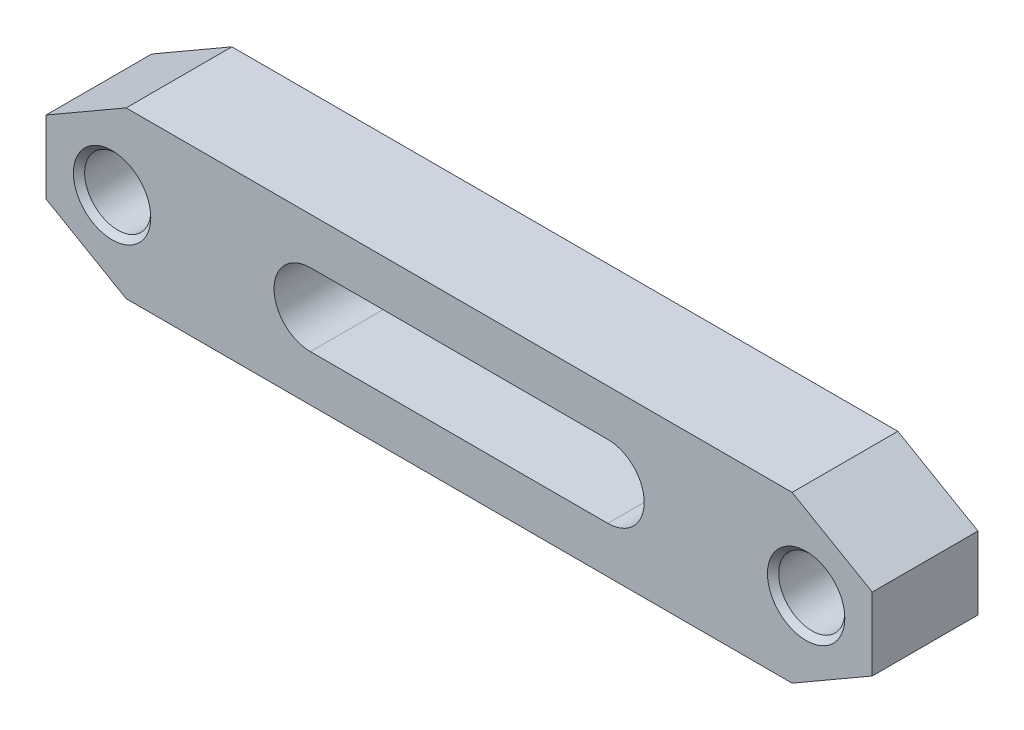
ISO-10303-21;
HEADER;
FILE_DESCRIPTION(('STEP AP214'),'2;1');
FILE_NAME('part.step','',(''),(''),'','','');
FILE_SCHEMA(('AUTOMOTIVE_DESIGN { 1 0 10303 214 1 1 1 1 }'));
ENDSEC;
DATA;
#1=APPLICATION_CONTEXT('core data for automotive mechanical design processes');
#2=APPLICATION_PROTOCOL_DEFINITION('international standard','automotive_design',2000,#1);
#3=PRODUCT_CONTEXT('',#1,'mechanical');
#4=PRODUCT('Part','Part','',(#3));
#5=PRODUCT_RELATED_PRODUCT_CATEGORY('part','',(#4));
#6=PRODUCT_DEFINITION_FORMATION('','',#4);
#7=PRODUCT_DEFINITION_CONTEXT('part definition',#1,'design');
#8=PRODUCT_DEFINITION('design','',#6,#7);
#9=PRODUCT_DEFINITION_SHAPE('','',#8);
#10=(LENGTH_UNIT() NAMED_UNIT(*) SI_UNIT(.MILLI.,.METRE.));
#11=(NAMED_UNIT(*) PLANE_ANGLE_UNIT() SI_UNIT($,.RADIAN.));
#12=(NAMED_UNIT(*) SI_UNIT($,.STERADIAN.) SOLID_ANGLE_UNIT());
#13=UNCERTAINTY_MEASURE_WITH_UNIT(LENGTH_MEASURE(1.E-05),#10,'distance_accuracy_value','');
#14=(GEOMETRIC_REPRESENTATION_CONTEXT(3) GLOBAL_UNCERTAINTY_ASSIGNED_CONTEXT((#13)) GLOBAL_UNIT_ASSIGNED_CONTEXT((#10,
#11,#12)) REPRESENTATION_CONTEXT('',''));
#15=CARTESIAN_POINT('',(0.,0.,0.));
#16=DIRECTION('',(0.,0.,1.));
#17=DIRECTION('',(1.,0.,0.));
#18=AXIS2_PLACEMENT_3D('',#15,#16,#17);
#19=CARTESIAN_POINT('',(62.5,-12.5,16.));
#20=DIRECTION('',(0.,0.,1.));
#21=DIRECTION('',(1.,0.,0.));
#22=AXIS2_PLACEMENT_3D('',#19,#20,#21);
#23=PLANE('',#22);
#24=CARTESIAN_POINT('',(52.5,0.,16.));
#25=DIRECTION('',(0.,0.,-1.));
#26=DIRECTION('',(-1.,0.,0.));
#27=AXIS2_PLACEMENT_3D('',#24,#25,#26);
#28=CIRCLE('',#27,5.85);
#29=CARTESIAN_POINT('',(46.65,0.,16.));
#30=VERTEX_POINT('',#29);
#31=EDGE_CURVE('E212',#30,#30,#28,.T.);
#32=ORIENTED_EDGE('',*,*,#31,.T.);
#33=EDGE_LOOP('',(#32));
#34=FACE_BOUND('',#33,.T.);
#35=CARTESIAN_POINT('',(-52.5,0.,16.));
#36=DIRECTION('',(0.,0.,-1.));
#37=DIRECTION('',(-1.,0.,0.));
#38=AXIS2_PLACEMENT_3D('',#35,#36,#37);
#39=CIRCLE('',#38,5.85);
#40=CARTESIAN_POINT('',(-58.35,0.,16.));
#41=VERTEX_POINT('',#40);
#42=EDGE_CURVE('E133',#41,#41,#39,.T.);
#43=ORIENTED_EDGE('',*,*,#42,.T.);
#44=EDGE_LOOP('',(#43));
#45=FACE_BOUND('',#44,.T.);
#46=DIRECTION('',(1.,0.,0.));
#47=VECTOR('',#46,1.);
#48=CARTESIAN_POINT('',(-50.375644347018,-12.5,16.));
#49=LINE('',#48,#47);
#50=CARTESIAN_POINT('',(-50.375644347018,-12.5,16.));
#51=VERTEX_POINT('',#50);
#52=CARTESIAN_POINT('',(50.375644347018,-12.5,16.));
#53=VERTEX_POINT('',#52);
#54=EDGE_CURVE('E143',#51,#53,#49,.T.);
#55=ORIENTED_EDGE('',*,*,#54,.T.);
#56=DIRECTION('',(0.866025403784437,0.5,0.));
#57=VECTOR('',#56,1.);
#58=CARTESIAN_POINT('',(50.375644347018,-12.5,16.));
#59=LINE('',#58,#57);
#60=CARTESIAN_POINT('',(62.5,-5.5,16.));
#61=VERTEX_POINT('',#60);
#62=EDGE_CURVE('E146',#53,#61,#59,.T.);
#63=ORIENTED_EDGE('',*,*,#62,.T.);
#64=DIRECTION('',(0.,1.,0.));
#65=VECTOR('',#64,1.);
#66=CARTESIAN_POINT('',(62.5,-5.5,16.));
#67=LINE('',#66,#65);
#68=CARTESIAN_POINT('',(62.5,5.5,16.));
#69=VERTEX_POINT('',#68);
#70=EDGE_CURVE('E149',#61,#69,#67,.T.);
#71=ORIENTED_EDGE('',*,*,#70,.T.);
#72=DIRECTION('',(-0.866025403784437,0.5,0.));
#73=VECTOR('',#72,1.);
#74=CARTESIAN_POINT('',(50.375644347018,12.5,16.));
#75=LINE('',#74,#73);
#76=CARTESIAN_POINT('',(50.375644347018,12.5,16.));
#77=VERTEX_POINT('',#76);
#78=EDGE_CURVE('E151',#69,#77,#75,.T.);
#79=ORIENTED_EDGE('',*,*,#78,.T.);
#80=DIRECTION('',(-1.,0.,0.));
#81=VECTOR('',#80,1.);
#82=CARTESIAN_POINT('',(-50.375644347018,12.5,16.));
#83=LINE('',#82,#81);
#84=CARTESIAN_POINT('',(-50.375644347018,12.5,16.));
#85=VERTEX_POINT('',#84);
#86=EDGE_CURVE('E153',#77,#85,#83,.T.);
#87=ORIENTED_EDGE('',*,*,#86,.T.);
#88=DIRECTION('',(-0.866025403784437,-0.5,0.));
#89=VECTOR('',#88,1.);
#90=CARTESIAN_POINT('',(-50.375644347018,12.5,16.));
#91=LINE('',#90,#89);
#92=CARTESIAN_POINT('',(-62.5,5.5,16.));
#93=VERTEX_POINT('',#92);
#94=EDGE_CURVE('E155',#85,#93,#91,.T.);
#95=ORIENTED_EDGE('',*,*,#94,.T.);
#96=DIRECTION('',(0.,-1.,0.));
#97=VECTOR('',#96,1.);
#98=CARTESIAN_POINT('',(-62.5,-5.5,16.));
#99=LINE('',#98,#97);
#100=CARTESIAN_POINT('',(-62.5,-5.5,16.));
#101=VERTEX_POINT('',#100);
#102=EDGE_CURVE('E157',#93,#101,#99,.T.);
#103=ORIENTED_EDGE('',*,*,#102,.T.);
#104=DIRECTION('',(0.866025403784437,-0.5,0.));
#105=VECTOR('',#104,1.);
#106=CARTESIAN_POINT('',(-50.375644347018,-12.5,16.));
#107=LINE('',#106,#105);
#108=EDGE_CURVE('E159',#101,#51,#107,.T.);
#109=ORIENTED_EDGE('',*,*,#108,.T.);
#110=EDGE_LOOP('',(#55,#63,#71,#79,#87,#95,#103,#109));
#111=FACE_BOUND('',#110,.T.);
#112=DIRECTION('',(-1.,0.,0.));
#113=VECTOR('',#112,1.);
#114=CARTESIAN_POINT('',(22.5,5.5,16.));
#115=LINE('',#114,#113);
#116=CARTESIAN_POINT('',(22.5,5.5,16.));
#117=VERTEX_POINT('',#116);
#118=CARTESIAN_POINT('',(-22.5,5.5,16.));
#119=VERTEX_POINT('',#118);
#120=EDGE_CURVE('E113',#117,#119,#115,.T.);
#121=ORIENTED_EDGE('',*,*,#120,.F.);
#122=CARTESIAN_POINT('',(22.5,0.,16.));
#123=DIRECTION('',(0.,0.,1.));
#124=DIRECTION('',(1.,0.,0.));
#125=AXIS2_PLACEMENT_3D('',#122,#123,#124);
#126=CIRCLE('',#125,5.5);
#127=CARTESIAN_POINT('',(22.5,-5.5,16.));
#128=VERTEX_POINT('',#127);
#129=EDGE_CURVE('E105',#128,#117,#126,.T.);
#130=ORIENTED_EDGE('',*,*,#129,.F.);
#131=DIRECTION('',(1.,0.,0.));
#132=VECTOR('',#131,1.);
#133=CARTESIAN_POINT('',(22.5,-5.5,16.));
#134=LINE('',#133,#132);
#135=CARTESIAN_POINT('',(-22.5,-5.5,16.));
#136=VERTEX_POINT('',#135);
#137=EDGE_CURVE('E127',#136,#128,#134,.T.);
#138=ORIENTED_EDGE('',*,*,#137,.F.);
#139=CARTESIAN_POINT('',(-22.5,0.,16.));
#140=DIRECTION('',(0.,0.,1.));
#141=DIRECTION('',(1.,0.,0.));
#142=AXIS2_PLACEMENT_3D('',#139,#140,#141);
#143=CIRCLE('',#142,5.5);
#144=EDGE_CURVE('E125',#119,#136,#143,.T.);
#145=ORIENTED_EDGE('',*,*,#144,.F.);
#146=EDGE_LOOP('',(#121,#130,#138,#145));
#147=FACE_BOUND('',#146,.T.);
#148=ADVANCED_FACE('F14',(#34,#45,#111,#147),#23,.T.);
#149=CARTESIAN_POINT('',(62.5,-12.5,0.));
#150=DIRECTION('',(0.,0.,1.));
#151=DIRECTION('',(1.,0.,0.));
#152=AXIS2_PLACEMENT_3D('',#149,#150,#151);
#153=PLANE('',#152);
#154=CARTESIAN_POINT('',(52.5,0.,0.));
#155=DIRECTION('',(0.,0.,-1.));
#156=DIRECTION('',(-1.,0.,0.));
#157=AXIS2_PLACEMENT_3D('',#154,#155,#156);
#158=CIRCLE('',#157,5.85);
#159=CARTESIAN_POINT('',(46.65,0.,0.));
#160=VERTEX_POINT('',#159);
#161=EDGE_CURVE('E202',#160,#160,#158,.T.);
#162=ORIENTED_EDGE('',*,*,#161,.F.);
#163=EDGE_LOOP('',(#162));
#164=FACE_BOUND('',#163,.T.);
#165=CARTESIAN_POINT('',(-52.5,0.,0.));
#166=DIRECTION('',(0.,0.,-1.));
#167=DIRECTION('',(-1.,0.,0.));
#168=AXIS2_PLACEMENT_3D('',#165,#166,#167);
#169=CIRCLE('',#168,5.85);
#170=CARTESIAN_POINT('',(-58.35,0.,0.));
#171=VERTEX_POINT('',#170);
#172=EDGE_CURVE('E215',#171,#171,#169,.T.);
#173=ORIENTED_EDGE('',*,*,#172,.F.);
#174=EDGE_LOOP('',(#173));
#175=FACE_BOUND('',#174,.T.);
#176=DIRECTION('',(1.,0.,0.));
#177=VECTOR('',#176,1.);
#178=CARTESIAN_POINT('',(-50.375644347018,-12.5,0.));
#179=LINE('',#178,#177);
#180=CARTESIAN_POINT('',(-50.375644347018,-12.5,0.));
#181=VERTEX_POINT('',#180);
#182=CARTESIAN_POINT('',(50.375644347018,-12.5,0.));
#183=VERTEX_POINT('',#182);
#184=EDGE_CURVE('E121',#181,#183,#179,.T.);
#185=ORIENTED_EDGE('',*,*,#184,.F.);
#186=DIRECTION('',(0.866025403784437,-0.5,0.));
#187=VECTOR('',#186,1.);
#188=CARTESIAN_POINT('',(-50.375644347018,-12.5,0.));
#189=LINE('',#188,#187);
#190=CARTESIAN_POINT('',(-62.5,-5.5,0.));
#191=VERTEX_POINT('',#190);
#192=EDGE_CURVE('E147',#191,#181,#189,.T.);
#193=ORIENTED_EDGE('',*,*,#192,.F.);
#194=DIRECTION('',(0.,-1.,0.));
#195=VECTOR('',#194,1.);
#196=CARTESIAN_POINT('',(-62.5,-5.5,0.));
#197=LINE('',#196,#195);
#198=CARTESIAN_POINT('',(-62.5,5.5,0.));
#199=VERTEX_POINT('',#198);
#200=EDGE_CURVE('E174',#199,#191,#197,.T.);
#201=ORIENTED_EDGE('',*,*,#200,.F.);
#202=DIRECTION('',(-0.866025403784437,-0.5,0.));
#203=VECTOR('',#202,1.);
#204=CARTESIAN_POINT('',(-50.375644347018,12.5,0.));
#205=LINE('',#204,#203);
#206=CARTESIAN_POINT('',(-50.375644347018,12.5,0.));
#207=VERTEX_POINT('',#206);
#208=EDGE_CURVE('E172',#207,#199,#205,.T.);
#209=ORIENTED_EDGE('',*,*,#208,.F.);
#210=DIRECTION('',(-1.,0.,0.));
#211=VECTOR('',#210,1.);
#212=CARTESIAN_POINT('',(-50.375644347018,12.5,0.));
#213=LINE('',#212,#211);
#214=CARTESIAN_POINT('',(50.375644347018,12.5,0.));
#215=VERTEX_POINT('',#214);
#216=EDGE_CURVE('E170',#215,#207,#213,.T.);
#217=ORIENTED_EDGE('',*,*,#216,.F.);
#218=DIRECTION('',(-0.866025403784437,0.5,0.));
#219=VECTOR('',#218,1.);
#220=CARTESIAN_POINT('',(50.375644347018,12.5,0.));
#221=LINE('',#220,#219);
#222=CARTESIAN_POINT('',(62.5,5.5,0.));
#223=VERTEX_POINT('',#222);
#224=EDGE_CURVE('E168',#223,#215,#221,.T.);
#225=ORIENTED_EDGE('',*,*,#224,.F.);
#226=DIRECTION('',(0.,1.,0.));
#227=VECTOR('',#226,1.);
#228=CARTESIAN_POINT('',(62.5,-5.5,0.));
#229=LINE('',#228,#227);
#230=CARTESIAN_POINT('',(62.5,-5.5,0.));
#231=VERTEX_POINT('',#230);
#232=EDGE_CURVE('E166',#231,#223,#229,.T.);
#233=ORIENTED_EDGE('',*,*,#232,.F.);
#234=DIRECTION('',(0.866025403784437,0.5,0.));
#235=VECTOR('',#234,1.);
#236=CARTESIAN_POINT('',(50.375644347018,-12.5,0.));
#237=LINE('',#236,#235);
#238=EDGE_CURVE('E164',#183,#231,#237,.T.);
#239=ORIENTED_EDGE('',*,*,#238,.F.);
#240=EDGE_LOOP('',(#185,#193,#201,#209,#217,#225,#233,#239));
#241=FACE_BOUND('',#240,.T.);
#242=CARTESIAN_POINT('',(22.5,0.,0.));
#243=DIRECTION('',(0.,0.,1.));
#244=DIRECTION('',(1.,0.,0.));
#245=AXIS2_PLACEMENT_3D('',#242,#243,#244);
#246=CIRCLE('',#245,5.5);
#247=CARTESIAN_POINT('',(22.5,-5.5,0.));
#248=VERTEX_POINT('',#247);
#249=CARTESIAN_POINT('',(22.5,5.5,0.));
#250=VERTEX_POINT('',#249);
#251=EDGE_CURVE('E39',#248,#250,#246,.T.);
#252=ORIENTED_EDGE('',*,*,#251,.T.);
#253=DIRECTION('',(-1.,0.,0.));
#254=VECTOR('',#253,1.);
#255=CARTESIAN_POINT('',(22.5,5.5,0.));
#256=LINE('',#255,#254);
#257=CARTESIAN_POINT('',(-22.5,5.5,0.));
#258=VERTEX_POINT('',#257);
#259=EDGE_CURVE('E120',#250,#258,#256,.T.);
#260=ORIENTED_EDGE('',*,*,#259,.T.);
#261=CARTESIAN_POINT('',(-22.5,0.,0.));
#262=DIRECTION('',(0.,0.,1.));
#263=DIRECTION('',(1.,0.,0.));
#264=AXIS2_PLACEMENT_3D('',#261,#262,#263);
#265=CIRCLE('',#264,5.5);
#266=CARTESIAN_POINT('',(-22.5,-5.5,0.));
#267=VERTEX_POINT('',#266);
#268=EDGE_CURVE('E135',#258,#267,#265,.T.);
#269=ORIENTED_EDGE('',*,*,#268,.T.);
#270=DIRECTION('',(1.,0.,0.));
#271=VECTOR('',#270,1.);
#272=CARTESIAN_POINT('',(22.5,-5.5,0.));
#273=LINE('',#272,#271);
#274=EDGE_CURVE('E114',#267,#248,#273,.T.);
#275=ORIENTED_EDGE('',*,*,#274,.T.);
#276=EDGE_LOOP('',(#252,#260,#269,#275));
#277=FACE_BOUND('',#276,.T.);
#278=ADVANCED_FACE('F238',(#164,#175,#241,#277),#153,.F.);
#279=CARTESIAN_POINT('',(-50.375644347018,-12.5,16.));
#280=DIRECTION('',(0.,1.,0.));
#281=DIRECTION('',(-1.,0.,0.));
#282=AXIS2_PLACEMENT_3D('',#279,#280,#281);
#283=PLANE('',#282);
#284=ORIENTED_EDGE('',*,*,#184,.T.);
#285=DIRECTION('',(0.,0.,-1.));
#286=VECTOR('',#285,1.);
#287=CARTESIAN_POINT('',(50.375644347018,-12.5,16.));
#288=LINE('',#287,#286);
#289=EDGE_CURVE('E9',#53,#183,#288,.T.);
#290=ORIENTED_EDGE('',*,*,#289,.F.);
#291=ORIENTED_EDGE('',*,*,#54,.F.);
#292=DIRECTION('',(0.,0.,-1.));
#293=VECTOR('',#292,1.);
#294=CARTESIAN_POINT('',(-50.375644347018,-12.5,16.));
#295=LINE('',#294,#293);
#296=EDGE_CURVE('E161',#51,#181,#295,.T.);
#297=ORIENTED_EDGE('',*,*,#296,.T.);
#298=EDGE_LOOP('',(#284,#290,#291,#297));
#299=FACE_BOUND('',#298,.T.);
#300=ADVANCED_FACE('F16',(#299),#283,.F.);
#301=CARTESIAN_POINT('',(50.375644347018,-12.5,16.));
#302=DIRECTION('',(-0.5,0.866025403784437,0.));
#303=DIRECTION('',(-0.866025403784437,-0.5,0.));
#304=AXIS2_PLACEMENT_3D('',#301,#302,#303);
#305=PLANE('',#304);
#306=ORIENTED_EDGE('',*,*,#238,.T.);
#307=DIRECTION('',(0.,0.,-1.));
#308=VECTOR('',#307,1.);
#309=CARTESIAN_POINT('',(62.5,-5.5,16.));
#310=LINE('',#309,#308);
#311=EDGE_CURVE('E23',#61,#231,#310,.T.);
#312=ORIENTED_EDGE('',*,*,#311,.F.);
#313=ORIENTED_EDGE('',*,*,#62,.F.);
#314=ORIENTED_EDGE('',*,*,#289,.T.);
#315=EDGE_LOOP('',(#306,#312,#313,#314));
#316=FACE_BOUND('',#315,.T.);
#317=ADVANCED_FACE('F271',(#316),#305,.F.);
#318=CARTESIAN_POINT('',(62.5,-5.5,16.));
#319=DIRECTION('',(-1.,0.,0.));
#320=DIRECTION('',(0.,0.,1.));
#321=AXIS2_PLACEMENT_3D('',#318,#319,#320);
#322=PLANE('',#321);
#323=ORIENTED_EDGE('',*,*,#232,.T.);
#324=DIRECTION('',(0.,0.,-1.));
#325=VECTOR('',#324,1.);
#326=CARTESIAN_POINT('',(62.5,5.5,16.));
#327=LINE('',#326,#325);
#328=EDGE_CURVE('E191',#69,#223,#327,.T.);
#329=ORIENTED_EDGE('',*,*,#328,.F.);
#330=ORIENTED_EDGE('',*,*,#70,.F.);
#331=ORIENTED_EDGE('',*,*,#311,.T.);
#332=EDGE_LOOP('',(#323,#329,#330,#331));
#333=FACE_BOUND('',#332,.T.);
#334=ADVANCED_FACE('F268',(#333),#322,.F.);
#335=CARTESIAN_POINT('',(50.375644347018,12.5,16.));
#336=DIRECTION('',(-0.5,-0.866025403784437,0.));
#337=DIRECTION('',(0.866025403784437,-0.5,0.));
#338=AXIS2_PLACEMENT_3D('',#335,#336,#337);
#339=PLANE('',#338);
#340=ORIENTED_EDGE('',*,*,#224,.T.);
#341=DIRECTION('',(0.,0.,-1.));
#342=VECTOR('',#341,1.);
#343=CARTESIAN_POINT('',(50.375644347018,12.5,16.));
#344=LINE('',#343,#342);
#345=EDGE_CURVE('E188',#77,#215,#344,.T.);
#346=ORIENTED_EDGE('',*,*,#345,.F.);
#347=ORIENTED_EDGE('',*,*,#78,.F.);
#348=ORIENTED_EDGE('',*,*,#328,.T.);
#349=EDGE_LOOP('',(#340,#346,#347,#348));
#350=FACE_BOUND('',#349,.T.);
#351=ADVANCED_FACE('F264',(#350),#339,.F.);
#352=CARTESIAN_POINT('',(-50.375644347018,12.5,16.));
#353=DIRECTION('',(0.,-1.,0.));
#354=DIRECTION('',(0.,0.,-1.));
#355=AXIS2_PLACEMENT_3D('',#352,#353,#354);
#356=PLANE('',#355);
#357=ORIENTED_EDGE('',*,*,#216,.T.);
#358=DIRECTION('',(0.,0.,-1.));
#359=VECTOR('',#358,1.);
#360=CARTESIAN_POINT('',(-50.375644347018,12.5,16.));
#361=LINE('',#360,#359);
#362=EDGE_CURVE('E185',#85,#207,#361,.T.);
#363=ORIENTED_EDGE('',*,*,#362,.F.);
#364=ORIENTED_EDGE('',*,*,#86,.F.);
#365=ORIENTED_EDGE('',*,*,#345,.T.);
#366=EDGE_LOOP('',(#357,#363,#364,#365));
#367=FACE_BOUND('',#366,.T.);
#368=ADVANCED_FACE('F260',(#367),#356,.F.);
#369=CARTESIAN_POINT('',(-50.375644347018,12.5,16.));
#370=DIRECTION('',(0.5,-0.866025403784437,0.));
#371=DIRECTION('',(0.866025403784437,0.5,0.));
#372=AXIS2_PLACEMENT_3D('',#369,#370,#371);
#373=PLANE('',#372);
#374=ORIENTED_EDGE('',*,*,#208,.T.);
#375=DIRECTION('',(0.,0.,-1.));
#376=VECTOR('',#375,1.);
#377=CARTESIAN_POINT('',(-62.5,5.5,16.));
#378=LINE('',#377,#376);
#379=EDGE_CURVE('E182',#93,#199,#378,.T.);
#380=ORIENTED_EDGE('',*,*,#379,.F.);
#381=ORIENTED_EDGE('',*,*,#94,.F.);
#382=ORIENTED_EDGE('',*,*,#362,.T.);
#383=EDGE_LOOP('',(#374,#380,#381,#382));
#384=FACE_BOUND('',#383,.T.);
#385=ADVANCED_FACE('F256',(#384),#373,.F.);
#386=CARTESIAN_POINT('',(-62.5,-5.5,16.));
#387=DIRECTION('',(1.,0.,0.));
#388=DIRECTION('',(0.,0.,-1.));
#389=AXIS2_PLACEMENT_3D('',#386,#387,#388);
#390=PLANE('',#389);
#391=ORIENTED_EDGE('',*,*,#200,.T.);
#392=DIRECTION('',(0.,0.,-1.));
#393=VECTOR('',#392,1.);
#394=CARTESIAN_POINT('',(-62.5,-5.5,16.));
#395=LINE('',#394,#393);
#396=EDGE_CURVE('E179',#101,#191,#395,.T.);
#397=ORIENTED_EDGE('',*,*,#396,.F.);
#398=ORIENTED_EDGE('',*,*,#102,.F.);
#399=ORIENTED_EDGE('',*,*,#379,.T.);
#400=EDGE_LOOP('',(#391,#397,#398,#399));
#401=FACE_BOUND('',#400,.T.);
#402=ADVANCED_FACE('F252',(#401),#390,.F.);
#403=CARTESIAN_POINT('',(-50.375644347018,-12.5,16.));
#404=DIRECTION('',(0.5,0.866025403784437,0.));
#405=DIRECTION('',(-0.866025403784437,0.5,0.));
#406=AXIS2_PLACEMENT_3D('',#403,#404,#405);
#407=PLANE('',#406);
#408=ORIENTED_EDGE('',*,*,#192,.T.);
#409=ORIENTED_EDGE('',*,*,#296,.F.);
#410=ORIENTED_EDGE('',*,*,#108,.F.);
#411=ORIENTED_EDGE('',*,*,#396,.T.);
#412=EDGE_LOOP('',(#408,#409,#410,#411));
#413=FACE_BOUND('',#412,.T.);
#414=ADVANCED_FACE('F249',(#413),#407,.F.);
#415=CARTESIAN_POINT('',(22.5,0.,16.));
#416=DIRECTION('',(0.,0.,-1.));
#417=DIRECTION('',(-1.,0.,0.));
#418=AXIS2_PLACEMENT_3D('',#415,#416,#417);
#419=CYLINDRICAL_SURFACE('',#418,5.5);
#420=ORIENTED_EDGE('',*,*,#251,.F.);
#421=DIRECTION('',(0.,0.,-1.));
#422=VECTOR('',#421,1.);
#423=CARTESIAN_POINT('',(22.5,-5.5,16.));
#424=LINE('',#423,#422);
#425=EDGE_CURVE('E109',#128,#248,#424,.T.);
#426=ORIENTED_EDGE('',*,*,#425,.F.);
#427=ORIENTED_EDGE('',*,*,#129,.T.);
#428=DIRECTION('',(0.,0.,-1.));
#429=VECTOR('',#428,1.);
#430=CARTESIAN_POINT('',(22.5,5.5,16.));
#431=LINE('',#430,#429);
#432=EDGE_CURVE('E108',#117,#250,#431,.T.);
#433=ORIENTED_EDGE('',*,*,#432,.T.);
#434=EDGE_LOOP('',(#420,#426,#427,#433));
#435=FACE_BOUND('',#434,.T.);
#436=ADVANCED_FACE('F107',(#435),#419,.F.);
#437=CARTESIAN_POINT('',(22.5,5.5,16.));
#438=DIRECTION('',(0.,-1.,0.));
#439=DIRECTION('',(1.,0.,0.));
#440=AXIS2_PLACEMENT_3D('',#437,#438,#439);
#441=PLANE('',#440);
#442=ORIENTED_EDGE('',*,*,#259,.F.);
#443=ORIENTED_EDGE('',*,*,#432,.F.);
#444=ORIENTED_EDGE('',*,*,#120,.T.);
#445=DIRECTION('',(0.,0.,-1.));
#446=VECTOR('',#445,1.);
#447=CARTESIAN_POINT('',(-22.5,5.5,16.));
#448=LINE('',#447,#446);
#449=EDGE_CURVE('E122',#119,#258,#448,.T.);
#450=ORIENTED_EDGE('',*,*,#449,.T.);
#451=EDGE_LOOP('',(#442,#443,#444,#450));
#452=FACE_BOUND('',#451,.T.);
#453=ADVANCED_FACE('F117',(#452),#441,.T.);
#454=CARTESIAN_POINT('',(-22.5,0.,16.));
#455=DIRECTION('',(0.,0.,-1.));
#456=DIRECTION('',(-1.,0.,0.));
#457=AXIS2_PLACEMENT_3D('',#454,#455,#456);
#458=CYLINDRICAL_SURFACE('',#457,5.5);
#459=ORIENTED_EDGE('',*,*,#268,.F.);
#460=ORIENTED_EDGE('',*,*,#449,.F.);
#461=ORIENTED_EDGE('',*,*,#144,.T.);
#462=DIRECTION('',(0.,0.,-1.));
#463=VECTOR('',#462,1.);
#464=CARTESIAN_POINT('',(-22.5,-5.5,16.));
#465=LINE('',#464,#463);
#466=EDGE_CURVE('E31',#136,#267,#465,.T.);
#467=ORIENTED_EDGE('',*,*,#466,.T.);
#468=EDGE_LOOP('',(#459,#460,#461,#467));
#469=FACE_BOUND('',#468,.T.);
#470=ADVANCED_FACE('F235',(#469),#458,.F.);
#471=CARTESIAN_POINT('',(22.5,-5.5,16.));
#472=DIRECTION('',(0.,1.,0.));
#473=DIRECTION('',(-1.,0.,0.));
#474=AXIS2_PLACEMENT_3D('',#471,#472,#473);
#475=PLANE('',#474);
#476=ORIENTED_EDGE('',*,*,#274,.F.);
#477=ORIENTED_EDGE('',*,*,#466,.F.);
#478=ORIENTED_EDGE('',*,*,#137,.T.);
#479=ORIENTED_EDGE('',*,*,#425,.T.);
#480=EDGE_LOOP('',(#476,#477,#478,#479));
#481=FACE_BOUND('',#480,.T.);
#482=ADVANCED_FACE('F225',(#481),#475,.T.);
#483=CARTESIAN_POINT('',(-52.5,0.,14.5));
#484=DIRECTION('',(0.,0.,1.));
#485=DIRECTION('',(1.,0.,0.));
#486=AXIS2_PLACEMENT_3D('',#483,#484,#485);
#487=CONICAL_SURFACE('',#486,4.35,0.78539816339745);
#488=CARTESIAN_POINT('',(-52.5,0.,15.15));
#489=DIRECTION('',(0.,0.,1.));
#490=DIRECTION('',(1.,0.,0.));
#491=AXIS2_PLACEMENT_3D('',#488,#489,#490);
#492=CIRCLE('',#491,5.);
#493=CARTESIAN_POINT('',(-47.5,0.,15.15));
#494=VERTEX_POINT('',#493);
#495=EDGE_CURVE('E197',#494,#494,#492,.F.);
#496=ORIENTED_EDGE('',*,*,#495,.T.);
#497=EDGE_LOOP('',(#496));
#498=FACE_BOUND('',#497,.T.);
#499=ORIENTED_EDGE('',*,*,#42,.F.);
#500=EDGE_LOOP('',(#499));
#501=FACE_BOUND('',#500,.T.);
#502=ADVANCED_FACE('F222',(#498,#501),#487,.F.);
#503=CARTESIAN_POINT('',(-52.5,0.,0.));
#504=DIRECTION('',(0.,0.,-1.));
#505=DIRECTION('',(-1.,0.,0.));
#506=AXIS2_PLACEMENT_3D('',#503,#504,#505);
#507=CONICAL_SURFACE('',#506,5.85,0.785398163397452);
#508=CARTESIAN_POINT('',(-52.5,0.,0.85));
#509=DIRECTION('',(0.,0.,-1.));
#510=DIRECTION('',(-1.,0.,0.));
#511=AXIS2_PLACEMENT_3D('',#508,#509,#510);
#512=CIRCLE('',#511,5.);
#513=CARTESIAN_POINT('',(-57.5,0.,0.85));
#514=VERTEX_POINT('',#513);
#515=EDGE_CURVE('E195',#514,#514,#512,.F.);
#516=ORIENTED_EDGE('',*,*,#515,.T.);
#517=EDGE_LOOP('',(#516));
#518=FACE_BOUND('',#517,.T.);
#519=ORIENTED_EDGE('',*,*,#172,.T.);
#520=EDGE_LOOP('',(#519));
#521=FACE_BOUND('',#520,.T.);
#522=ADVANCED_FACE('F224',(#518,#521),#507,.F.);
#523=CARTESIAN_POINT('',(52.5,0.,14.5));
#524=DIRECTION('',(0.,0.,1.));
#525=DIRECTION('',(1.,0.,0.));
#526=AXIS2_PLACEMENT_3D('',#523,#524,#525);
#527=CONICAL_SURFACE('',#526,4.35,0.78539816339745);
#528=CARTESIAN_POINT('',(52.5,0.,15.15));
#529=DIRECTION('',(0.,0.,1.));
#530=DIRECTION('',(1.,0.,0.));
#531=AXIS2_PLACEMENT_3D('',#528,#529,#530);
#532=CIRCLE('',#531,5.);
#533=CARTESIAN_POINT('',(57.5,0.,15.15));
#534=VERTEX_POINT('',#533);
#535=EDGE_CURVE('E198',#534,#534,#532,.F.);
#536=ORIENTED_EDGE('',*,*,#535,.T.);
#537=EDGE_LOOP('',(#536));
#538=FACE_BOUND('',#537,.T.);
#539=ORIENTED_EDGE('',*,*,#31,.F.);
#540=EDGE_LOOP('',(#539));
#541=FACE_BOUND('',#540,.T.);
#542=ADVANCED_FACE('F233',(#538,#541),#527,.F.);
#543=CARTESIAN_POINT('',(52.5,0.,0.));
#544=DIRECTION('',(0.,0.,-1.));
#545=DIRECTION('',(-1.,0.,0.));
#546=AXIS2_PLACEMENT_3D('',#543,#544,#545);
#547=CONICAL_SURFACE('',#546,5.85,0.785398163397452);
#548=CARTESIAN_POINT('',(52.5,0.,0.85));
#549=DIRECTION('',(0.,0.,-1.));
#550=DIRECTION('',(-1.,0.,0.));
#551=AXIS2_PLACEMENT_3D('',#548,#549,#550);
#552=CIRCLE('',#551,5.);
#553=CARTESIAN_POINT('',(47.5,0.,0.85));
#554=VERTEX_POINT('',#553);
#555=EDGE_CURVE('E18',#554,#554,#552,.F.);
#556=ORIENTED_EDGE('',*,*,#555,.T.);
#557=EDGE_LOOP('',(#556));
#558=FACE_BOUND('',#557,.T.);
#559=ORIENTED_EDGE('',*,*,#161,.T.);
#560=EDGE_LOOP('',(#559));
#561=FACE_BOUND('',#560,.T.);
#562=ADVANCED_FACE('F398',(#558,#561),#547,.F.);
#563=CARTESIAN_POINT('',(-52.5,0.,0.));
#564=DIRECTION('',(0.,0.,1.));
#565=DIRECTION('',(1.,0.,0.));
#566=AXIS2_PLACEMENT_3D('',#563,#564,#565);
#567=CYLINDRICAL_SURFACE('',#566,5.);
#568=ORIENTED_EDGE('',*,*,#515,.F.);
#569=EDGE_LOOP('',(#568));
#570=FACE_BOUND('',#569,.T.);
#571=ORIENTED_EDGE('',*,*,#495,.F.);
#572=EDGE_LOOP('',(#571));
#573=FACE_BOUND('',#572,.T.);
#574=ADVANCED_FACE('F407',(#570,#573),#567,.F.);
#575=CARTESIAN_POINT('',(52.5,0.,0.));
#576=DIRECTION('',(0.,0.,1.));
#577=DIRECTION('',(1.,0.,0.));
#578=AXIS2_PLACEMENT_3D('',#575,#576,#577);
#579=CYLINDRICAL_SURFACE('',#578,5.);
#580=ORIENTED_EDGE('',*,*,#555,.F.);
#581=EDGE_LOOP('',(#580));
#582=FACE_BOUND('',#581,.T.);
#583=ORIENTED_EDGE('',*,*,#535,.F.);
#584=EDGE_LOOP('',(#583));
#585=FACE_BOUND('',#584,.T.);
#586=ADVANCED_FACE('F417',(#582,#585),#579,.F.);
#587=CLOSED_SHELL('',(#148,#278,#300,#317,#334,#351,#368,#385,#402,#414,#436,#453,#470,#482,
#502,#522,#542,#562,#574,#586));
#588=MANIFOLD_SOLID_BREP('B1',#587);
#589=ADVANCED_BREP_SHAPE_REPRESENTATION('',(#18,#588),#14);
#590=SHAPE_DEFINITION_REPRESENTATION(#9,#589);
ENDSEC;
END-ISO-10303-21;
